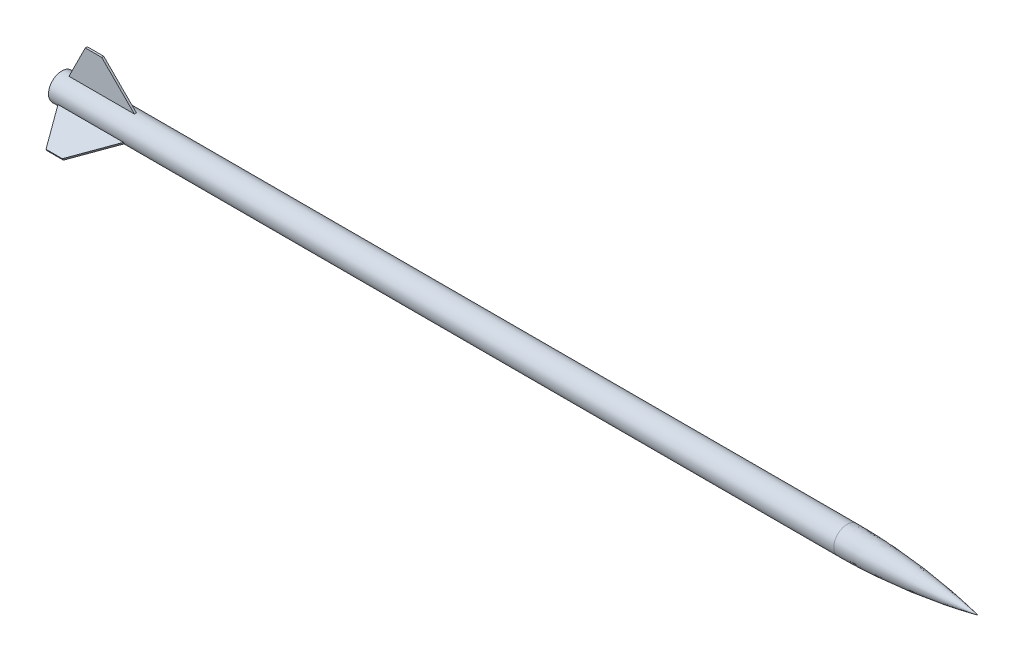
ISO-10303-21;
HEADER;
FILE_DESCRIPTION(('STEP AP214'),'2;1');
FILE_NAME('part.step','',(''),(''),'','','');
FILE_SCHEMA(('AUTOMOTIVE_DESIGN { 1 0 10303 214 1 1 1 1 }'));
ENDSEC;
DATA;
#1=APPLICATION_CONTEXT('core data for automotive mechanical design processes');
#2=APPLICATION_PROTOCOL_DEFINITION('international standard','automotive_design',2000,#1);
#3=PRODUCT_CONTEXT('',#1,'mechanical');
#4=PRODUCT('Part','Part','',(#3));
#5=PRODUCT_RELATED_PRODUCT_CATEGORY('part','',(#4));
#6=PRODUCT_DEFINITION_FORMATION('','',#4);
#7=PRODUCT_DEFINITION_CONTEXT('part definition',#1,'design');
#8=PRODUCT_DEFINITION('design','',#6,#7);
#9=PRODUCT_DEFINITION_SHAPE('','',#8);
#10=(LENGTH_UNIT() NAMED_UNIT(*) SI_UNIT(.MILLI.,.METRE.));
#11=(NAMED_UNIT(*) PLANE_ANGLE_UNIT() SI_UNIT($,.RADIAN.));
#12=(NAMED_UNIT(*) SI_UNIT($,.STERADIAN.) SOLID_ANGLE_UNIT());
#13=UNCERTAINTY_MEASURE_WITH_UNIT(LENGTH_MEASURE(1.E-05),#10,'distance_accuracy_value','');
#14=(GEOMETRIC_REPRESENTATION_CONTEXT(3) GLOBAL_UNCERTAINTY_ASSIGNED_CONTEXT((#13)) GLOBAL_UNIT_ASSIGNED_CONTEXT((#10,
#11,#12)) REPRESENTATION_CONTEXT('',''));
#15=CARTESIAN_POINT('',(0.,0.,0.));
#16=DIRECTION('',(0.,0.,1.));
#17=DIRECTION('',(1.,0.,0.));
#18=AXIS2_PLACEMENT_3D('',#15,#16,#17);
#19=CARTESIAN_POINT('',(406.4,0.,0.));
#20=DIRECTION('',(-1.,0.,0.));
#21=DIRECTION('',(0.,0.,1.));
#22=AXIS2_PLACEMENT_3D('',#19,#20,#21);
#23=CYLINDRICAL_SURFACE('',#22,6.8834);
#24=CARTESIAN_POINT('',(38.1,0.,0.));
#25=DIRECTION('',(-1.,0.,0.));
#26=DIRECTION('',(0.,0.,1.));
#27=AXIS2_PLACEMENT_3D('',#24,#25,#26);
#28=CIRCLE('',#27,6.8834);
#29=CARTESIAN_POINT('',(38.1,-2.97324309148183,-6.20814151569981));
#30=VERTEX_POINT('',#29);
#31=CARTESIAN_POINT('',(38.1,-2.99533813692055,-6.19751119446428));
#32=VERTEX_POINT('',#31);
#33=EDGE_CURVE('E38',#30,#32,#28,.T.);
#34=ORIENTED_EDGE('',*,*,#33,.F.);
#35=DIRECTION('',(-1.,0.,0.));
#36=VECTOR('',#35,1.);
#37=CARTESIAN_POINT('',(406.4,-2.97324309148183,-6.20814151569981));
#38=LINE('',#37,#36);
#39=CARTESIAN_POINT('',(4.23333333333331,-2.97324309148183,-6.20814151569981));
#40=VERTEX_POINT('',#39);
#41=EDGE_CURVE('E11',#30,#40,#38,.T.);
#42=ORIENTED_EDGE('',*,*,#41,.T.);
#43=CARTESIAN_POINT('',(4.23333333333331,0.,0.));
#44=DIRECTION('',(1.,0.,0.));
#45=DIRECTION('',(0.,0.,-1.));
#46=AXIS2_PLACEMENT_3D('',#43,#44,#45);
#47=CIRCLE('',#46,6.8834);
#48=CARTESIAN_POINT('',(4.23333333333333,-2.99533865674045,-6.19751094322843));
#49=VERTEX_POINT('',#48);
#50=EDGE_CURVE('E274',#49,#40,#47,.T.);
#51=ORIENTED_EDGE('',*,*,#50,.F.);
#52=CARTESIAN_POINT('',(0.800897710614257,0.,0.));
#53=DIRECTION('',(0.894427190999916,0.223606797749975,0.387298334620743));
#54=DIRECTION('',(-0.447213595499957,0.447213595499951,0.774596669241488));
#55=AXIS2_PLACEMENT_3D('',#52,#53,#54);
#56=ELLIPSE('',#55,7.69587515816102,6.8834);
#57=CARTESIAN_POINT('',(4.23333333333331,-3.86953258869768,-5.692794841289));
#58=VERTEX_POINT('',#57);
#59=EDGE_CURVE('E273',#58,#49,#56,.T.);
#60=ORIENTED_EDGE('',*,*,#59,.F.);
#61=CARTESIAN_POINT('',(4.23333333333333,-3.88978671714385,-5.67897480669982));
#62=VERTEX_POINT('',#61);
#63=EDGE_CURVE('E270',#62,#58,#47,.T.);
#64=ORIENTED_EDGE('',*,*,#63,.F.);
#65=DIRECTION('',(-1.,0.,0.));
#66=VECTOR('',#65,1.);
#67=CARTESIAN_POINT('',(406.4,-3.88978671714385,-5.67897480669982));
#68=LINE('',#67,#66);
#69=CARTESIAN_POINT('',(38.1,-3.88978671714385,-5.67897480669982));
#70=VERTEX_POINT('',#69);
#71=EDGE_CURVE('E267',#70,#62,#68,.T.);
#72=ORIENTED_EDGE('',*,*,#71,.F.);
#73=CARTESIAN_POINT('',(38.1,-3.8695330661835,-5.69279451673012));
#74=VERTEX_POINT('',#73);
#75=EDGE_CURVE('E277',#74,#70,#28,.T.);
#76=ORIENTED_EDGE('',*,*,#75,.F.);
#77=CARTESIAN_POINT('',(44.9648712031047,0.,0.));
#78=DIRECTION('',(-0.707106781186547,0.353553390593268,0.612372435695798));
#79=DIRECTION('',(-0.707106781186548,-0.353553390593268,-0.612372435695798));
#80=AXIS2_PLACEMENT_3D('',#77,#78,#79);
#81=ELLIPSE('',#80,9.73459763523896,6.8834);
#82=EDGE_CURVE('E48',#32,#74,#81,.T.);
#83=ORIENTED_EDGE('',*,*,#82,.F.);
#84=EDGE_LOOP('',(#34,#42,#51,#60,#64,#72,#76,#83));
#85=FACE_BOUND('',#84,.T.);
#86=CARTESIAN_POINT('',(38.1,0.,0.));
#87=DIRECTION('',(-1.,0.,0.));
#88=DIRECTION('',(0.,0.,1.));
#89=AXIS2_PLACEMENT_3D('',#86,#87,#88);
#90=CIRCLE('',#89,6.8834);
#91=CARTESIAN_POINT('',(38.1,-3.88978671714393,5.67897480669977));
#92=VERTEX_POINT('',#91);
#93=CARTESIAN_POINT('',(38.1,-3.86953306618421,5.69279451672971));
#94=VERTEX_POINT('',#93);
#95=EDGE_CURVE('E211',#92,#94,#90,.T.);
#96=ORIENTED_EDGE('',*,*,#95,.F.);
#97=DIRECTION('',(-1.,0.,0.));
#98=VECTOR('',#97,1.);
#99=CARTESIAN_POINT('',(406.4,-3.88978671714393,5.67897480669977));
#100=LINE('',#99,#98);
#101=CARTESIAN_POINT('',(4.23333333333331,-3.88978671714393,5.67897480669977));
#102=VERTEX_POINT('',#101);
#103=EDGE_CURVE('E265',#92,#102,#100,.T.);
#104=ORIENTED_EDGE('',*,*,#103,.T.);
#105=CARTESIAN_POINT('',(4.23333333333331,0.,0.));
#106=DIRECTION('',(1.,0.,0.));
#107=DIRECTION('',(0.,0.,-1.));
#108=AXIS2_PLACEMENT_3D('',#105,#106,#107);
#109=CIRCLE('',#108,6.8834);
#110=CARTESIAN_POINT('',(4.23333333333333,-3.86953258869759,5.69279484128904));
#111=VERTEX_POINT('',#110);
#112=EDGE_CURVE('E256',#111,#102,#109,.T.);
#113=ORIENTED_EDGE('',*,*,#112,.F.);
#114=CARTESIAN_POINT('',(0.800897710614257,0.,0.));
#115=DIRECTION('',(0.894427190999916,0.22360679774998,-0.38729833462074));
#116=DIRECTION('',(-0.447213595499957,0.447213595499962,-0.774596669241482));
#117=AXIS2_PLACEMENT_3D('',#114,#115,#116);
#118=ELLIPSE('',#117,7.69587515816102,6.8834);
#119=CARTESIAN_POINT('',(4.23333333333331,-2.9953386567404,6.19751094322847));
#120=VERTEX_POINT('',#119);
#121=EDGE_CURVE('E255',#120,#111,#118,.T.);
#122=ORIENTED_EDGE('',*,*,#121,.F.);
#123=CARTESIAN_POINT('',(4.23333333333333,-2.97324309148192,6.20814151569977));
#124=VERTEX_POINT('',#123);
#125=EDGE_CURVE('E252',#124,#120,#109,.T.);
#126=ORIENTED_EDGE('',*,*,#125,.F.);
#127=DIRECTION('',(-1.,0.,0.));
#128=VECTOR('',#127,1.);
#129=CARTESIAN_POINT('',(406.4,-2.97324309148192,6.20814151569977));
#130=LINE('',#129,#128);
#131=CARTESIAN_POINT('',(38.1,-2.97324309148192,6.20814151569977));
#132=VERTEX_POINT('',#131);
#133=EDGE_CURVE('E249',#132,#124,#130,.T.);
#134=ORIENTED_EDGE('',*,*,#133,.F.);
#135=CARTESIAN_POINT('',(38.1,-2.99533813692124,6.19751119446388));
#136=VERTEX_POINT('',#135);
#137=EDGE_CURVE('E259',#136,#132,#90,.T.);
#138=ORIENTED_EDGE('',*,*,#137,.F.);
#139=CARTESIAN_POINT('',(44.9648712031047,0.,0.));
#140=DIRECTION('',(-0.707106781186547,0.353553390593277,-0.612372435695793));
#141=DIRECTION('',(-0.707106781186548,-0.353553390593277,0.612372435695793));
#142=AXIS2_PLACEMENT_3D('',#139,#140,#141);
#143=ELLIPSE('',#142,9.73459763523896,6.8834);
#144=EDGE_CURVE('E262',#94,#136,#143,.T.);
#145=ORIENTED_EDGE('',*,*,#144,.F.);
#146=EDGE_LOOP('',(#96,#104,#113,#122,#126,#134,#138,#145));
#147=FACE_BOUND('',#146,.T.);
#148=CARTESIAN_POINT('',(38.1,0.,0.));
#149=DIRECTION('',(-1.,0.,0.));
#150=DIRECTION('',(0.,0.,1.));
#151=AXIS2_PLACEMENT_3D('',#148,#149,#150);
#152=CIRCLE('',#151,6.8834);
#153=CARTESIAN_POINT('',(38.1,6.86302980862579,0.529166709));
#154=VERTEX_POINT('',#153);
#155=CARTESIAN_POINT('',(38.1,6.86487120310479,0.504716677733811));
#156=VERTEX_POINT('',#155);
#157=EDGE_CURVE('E215',#154,#156,#152,.T.);
#158=ORIENTED_EDGE('',*,*,#157,.F.);
#159=DIRECTION('',(-1.,0.,0.));
#160=VECTOR('',#159,1.);
#161=CARTESIAN_POINT('',(406.4,6.86302980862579,0.529166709));
#162=LINE('',#161,#160);
#163=CARTESIAN_POINT('',(4.23333333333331,6.86302980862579,0.529166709));
#164=VERTEX_POINT('',#163);
#165=EDGE_CURVE('E247',#154,#164,#162,.T.);
#166=ORIENTED_EDGE('',*,*,#165,.T.);
#167=CARTESIAN_POINT('',(4.23333333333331,0.,0.));
#168=DIRECTION('',(1.,0.,0.));
#169=DIRECTION('',(0.,0.,-1.));
#170=AXIS2_PLACEMENT_3D('',#167,#168,#169);
#171=CIRCLE('',#170,6.8834);
#172=CARTESIAN_POINT('',(4.23333333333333,6.86487124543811,0.50471610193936));
#173=VERTEX_POINT('',#172);
#174=EDGE_CURVE('E238',#173,#164,#171,.T.);
#175=ORIENTED_EDGE('',*,*,#174,.F.);
#176=CARTESIAN_POINT('',(0.800897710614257,0.,0.));
#177=DIRECTION('',(0.894427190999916,-0.447213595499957,0.));
#178=DIRECTION('',(-0.447213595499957,-0.894427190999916,0.));
#179=AXIS2_PLACEMENT_3D('',#176,#177,#178);
#180=ELLIPSE('',#179,7.69587515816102,6.8834);
#181=CARTESIAN_POINT('',(4.23333333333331,6.86487124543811,-0.504716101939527));
#182=VERTEX_POINT('',#181);
#183=EDGE_CURVE('E237',#182,#173,#180,.T.);
#184=ORIENTED_EDGE('',*,*,#183,.F.);
#185=CARTESIAN_POINT('',(4.23333333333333,6.86302980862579,-0.529166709));
#186=VERTEX_POINT('',#185);
#187=EDGE_CURVE('E234',#186,#182,#171,.T.);
#188=ORIENTED_EDGE('',*,*,#187,.F.);
#189=DIRECTION('',(-1.,0.,0.));
#190=VECTOR('',#189,1.);
#191=CARTESIAN_POINT('',(406.4,6.86302980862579,-0.529166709));
#192=LINE('',#191,#190);
#193=CARTESIAN_POINT('',(38.1,6.86302980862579,-0.529166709));
#194=VERTEX_POINT('',#193);
#195=EDGE_CURVE('E225',#194,#186,#192,.T.);
#196=ORIENTED_EDGE('',*,*,#195,.F.);
#197=CARTESIAN_POINT('',(38.1,6.86487120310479,-0.504716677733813));
#198=VERTEX_POINT('',#197);
#199=EDGE_CURVE('E241',#198,#194,#152,.T.);
#200=ORIENTED_EDGE('',*,*,#199,.F.);
#201=CARTESIAN_POINT('',(44.9648712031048,0.,0.));
#202=DIRECTION('',(-0.707106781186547,-0.707106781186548,0.));
#203=DIRECTION('',(-0.707106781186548,0.707106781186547,0.));
#204=AXIS2_PLACEMENT_3D('',#201,#202,#203);
#205=ELLIPSE('',#204,9.73459763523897,6.8834);
#206=EDGE_CURVE('E244',#156,#198,#205,.T.);
#207=ORIENTED_EDGE('',*,*,#206,.F.);
#208=EDGE_LOOP('',(#158,#166,#175,#184,#188,#196,#200,#207));
#209=FACE_BOUND('',#208,.T.);
#210=CARTESIAN_POINT('',(406.4,0.,0.));
#211=DIRECTION('',(1.,0.,0.));
#212=DIRECTION('',(0.,0.,-1.));
#213=AXIS2_PLACEMENT_3D('',#210,#211,#212);
#214=CIRCLE('',#213,6.8834);
#215=CARTESIAN_POINT('',(406.4,0.,-6.8834));
#216=VERTEX_POINT('',#215);
#217=EDGE_CURVE('E219',#216,#216,#214,.T.);
#218=ORIENTED_EDGE('',*,*,#217,.F.);
#219=EDGE_LOOP('',(#218));
#220=FACE_BOUND('',#219,.T.);
#221=CARTESIAN_POINT('',(0.,0.,0.));
#222=DIRECTION('',(1.,0.,0.));
#223=DIRECTION('',(0.,0.,-1.));
#224=AXIS2_PLACEMENT_3D('',#221,#222,#223);
#225=CIRCLE('',#224,6.8834);
#226=CARTESIAN_POINT('',(0.,0.,-6.8834));
#227=VERTEX_POINT('',#226);
#228=EDGE_CURVE('E222',#227,#227,#225,.T.);
#229=ORIENTED_EDGE('',*,*,#228,.T.);
#230=EDGE_LOOP('',(#229));
#231=FACE_BOUND('',#230,.T.);
#232=ADVANCED_FACE('F31',(#85,#147,#209,#220,#231),#23,.T.);
#233=CARTESIAN_POINT('',(0.,0.,0.));
#234=DIRECTION('',(1.,0.,0.));
#235=DIRECTION('',(0.,0.,-1.));
#236=AXIS2_PLACEMENT_3D('',#233,#234,#235);
#237=PLANE('',#236);
#238=ORIENTED_EDGE('',*,*,#228,.F.);
#239=EDGE_LOOP('',(#238));
#240=FACE_BOUND('',#239,.T.);
#241=ADVANCED_FACE('F202',(#240),#237,.F.);
#242=CARTESIAN_POINT('',(38.1,5.33791993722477,0.529166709));
#243=DIRECTION('',(-1.,0.,0.));
#244=DIRECTION('',(0.,0.,1.));
#245=AXIS2_PLACEMENT_3D('',#242,#243,#244);
#246=PLANE('',#245);
#247=DIRECTION('',(0.,1.,0.));
#248=VECTOR('',#247,1.);
#249=CARTESIAN_POINT('',(38.1,5.33791993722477,0.529166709));
#250=LINE('',#249,#248);
#251=CARTESIAN_POINT('',(38.1,6.86487120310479,0.529166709));
#252=VERTEX_POINT('',#251);
#253=EDGE_CURVE('E363',#154,#252,#250,.T.);
#254=ORIENTED_EDGE('',*,*,#253,.F.);
#255=ORIENTED_EDGE('',*,*,#157,.T.);
#256=DIRECTION('',(0.,0.,-1.));
#257=VECTOR('',#256,1.);
#258=CARTESIAN_POINT('',(38.1,6.86487120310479,0.529166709));
#259=LINE('',#258,#257);
#260=EDGE_CURVE('E223',#252,#156,#259,.T.);
#261=ORIENTED_EDGE('',*,*,#260,.F.);
#262=EDGE_LOOP('',(#254,#255,#261));
#263=FACE_BOUND('',#262,.T.);
#264=ADVANCED_FACE('F206',(#263),#246,.F.);
#265=CARTESIAN_POINT('',(38.1,6.86487120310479,-0.529166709));
#266=VERTEX_POINT('',#265);
#267=EDGE_CURVE('E228',#198,#266,#259,.T.);
#268=ORIENTED_EDGE('',*,*,#267,.F.);
#269=ORIENTED_EDGE('',*,*,#199,.T.);
#270=DIRECTION('',(0.,1.,0.));
#271=VECTOR('',#270,1.);
#272=CARTESIAN_POINT('',(38.1,5.33791993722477,-0.529166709));
#273=LINE('',#272,#271);
#274=EDGE_CURVE('E348',#194,#266,#273,.T.);
#275=ORIENTED_EDGE('',*,*,#274,.T.);
#276=EDGE_LOOP('',(#268,#269,#275));
#277=FACE_BOUND('',#276,.T.);
#278=ADVANCED_FACE('F390',(#277),#246,.F.);
#279=CARTESIAN_POINT('',(21.1666666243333,23.7982045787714,0.529166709));
#280=DIRECTION('',(-0.707106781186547,-0.707106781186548,0.));
#281=DIRECTION('',(0.707106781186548,-0.707106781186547,0.));
#282=AXIS2_PLACEMENT_3D('',#279,#280,#281);
#283=PLANE('',#282);
#284=ORIENTED_EDGE('',*,*,#260,.T.);
#285=ORIENTED_EDGE('',*,*,#206,.T.);
#286=ORIENTED_EDGE('',*,*,#267,.T.);
#287=DIRECTION('',(-0.707106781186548,0.707106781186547,0.));
#288=VECTOR('',#287,1.);
#289=CARTESIAN_POINT('',(21.1666666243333,23.7982045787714,-0.529166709));
#290=LINE('',#289,#288);
#291=CARTESIAN_POINT('',(21.1666666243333,23.7982045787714,-0.529166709));
#292=VERTEX_POINT('',#291);
#293=EDGE_CURVE('E351',#266,#292,#290,.T.);
#294=ORIENTED_EDGE('',*,*,#293,.T.);
#295=DIRECTION('',(0.,0.,-1.));
#296=VECTOR('',#295,1.);
#297=CARTESIAN_POINT('',(21.1666666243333,23.7982045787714,0.529166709));
#298=LINE('',#297,#296);
#299=CARTESIAN_POINT('',(21.1666666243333,23.7982045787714,0.529166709));
#300=VERTEX_POINT('',#299);
#301=EDGE_CURVE('E379',#300,#292,#298,.T.);
#302=ORIENTED_EDGE('',*,*,#301,.F.);
#303=DIRECTION('',(-0.707106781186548,0.707106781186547,0.));
#304=VECTOR('',#303,1.);
#305=CARTESIAN_POINT('',(21.1666666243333,23.7982045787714,0.529166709));
#306=LINE('',#305,#304);
#307=EDGE_CURVE('E365',#252,#300,#306,.T.);
#308=ORIENTED_EDGE('',*,*,#307,.F.);
#309=EDGE_LOOP('',(#284,#285,#286,#294,#302,#308));
#310=FACE_BOUND('',#309,.T.);
#311=ADVANCED_FACE('F386',(#310),#283,.F.);
#312=CARTESIAN_POINT('',(4.23333333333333,6.86487124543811,0.529166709));
#313=DIRECTION('',(0.894427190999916,-0.447213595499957,0.));
#314=DIRECTION('',(0.447213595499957,0.894427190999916,0.));
#315=AXIS2_PLACEMENT_3D('',#312,#313,#314);
#316=PLANE('',#315);
#317=DIRECTION('',(0.,0.,-1.));
#318=VECTOR('',#317,1.);
#319=CARTESIAN_POINT('',(4.23333333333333,6.86487124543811,0.529166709));
#320=LINE('',#319,#318);
#321=CARTESIAN_POINT('',(4.23333333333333,6.86487124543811,-0.529166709));
#322=VERTEX_POINT('',#321);
#323=EDGE_CURVE('E374',#182,#322,#320,.T.);
#324=ORIENTED_EDGE('',*,*,#323,.F.);
#325=ORIENTED_EDGE('',*,*,#183,.T.);
#326=CARTESIAN_POINT('',(4.23333333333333,6.86487124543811,0.529166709));
#327=VERTEX_POINT('',#326);
#328=EDGE_CURVE('E375',#327,#173,#320,.T.);
#329=ORIENTED_EDGE('',*,*,#328,.F.);
#330=DIRECTION('',(-0.447213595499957,-0.894427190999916,0.));
#331=VECTOR('',#330,1.);
#332=CARTESIAN_POINT('',(4.23333333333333,6.86487124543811,0.529166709));
#333=LINE('',#332,#331);
#334=CARTESIAN_POINT('',(12.7,23.7982045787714,0.529166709));
#335=VERTEX_POINT('',#334);
#336=EDGE_CURVE('E369',#335,#327,#333,.T.);
#337=ORIENTED_EDGE('',*,*,#336,.F.);
#338=DIRECTION('',(0.,0.,-1.));
#339=VECTOR('',#338,1.);
#340=CARTESIAN_POINT('',(12.7,23.7982045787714,0.529166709));
#341=LINE('',#340,#339);
#342=CARTESIAN_POINT('',(12.7,23.7982045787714,-0.529166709));
#343=VERTEX_POINT('',#342);
#344=EDGE_CURVE('E378',#335,#343,#341,.T.);
#345=ORIENTED_EDGE('',*,*,#344,.T.);
#346=DIRECTION('',(-0.447213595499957,-0.894427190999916,0.));
#347=VECTOR('',#346,1.);
#348=CARTESIAN_POINT('',(4.23333333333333,6.86487124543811,-0.529166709));
#349=LINE('',#348,#347);
#350=EDGE_CURVE('E357',#343,#322,#349,.T.);
#351=ORIENTED_EDGE('',*,*,#350,.T.);
#352=EDGE_LOOP('',(#324,#325,#329,#337,#345,#351));
#353=FACE_BOUND('',#352,.T.);
#354=ADVANCED_FACE('F401',(#353),#316,.F.);
#355=CARTESIAN_POINT('',(4.23333333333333,6.86487124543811,0.529166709));
#356=DIRECTION('',(1.,0.,0.));
#357=DIRECTION('',(0.,0.,-1.));
#358=AXIS2_PLACEMENT_3D('',#355,#356,#357);
#359=PLANE('',#358);
#360=DIRECTION('',(0.,-1.,0.));
#361=VECTOR('',#360,1.);
#362=CARTESIAN_POINT('',(4.23333333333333,6.86487124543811,-0.529166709));
#363=LINE('',#362,#361);
#364=EDGE_CURVE('E360',#322,#186,#363,.T.);
#365=ORIENTED_EDGE('',*,*,#364,.T.);
#366=ORIENTED_EDGE('',*,*,#187,.T.);
#367=ORIENTED_EDGE('',*,*,#323,.T.);
#368=EDGE_LOOP('',(#365,#366,#367));
#369=FACE_BOUND('',#368,.T.);
#370=ADVANCED_FACE('F422',(#369),#359,.F.);
#371=ORIENTED_EDGE('',*,*,#328,.T.);
#372=ORIENTED_EDGE('',*,*,#174,.T.);
#373=DIRECTION('',(0.,-1.,0.));
#374=VECTOR('',#373,1.);
#375=CARTESIAN_POINT('',(4.23333333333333,6.86487124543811,0.529166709));
#376=LINE('',#375,#374);
#377=EDGE_CURVE('E371',#327,#164,#376,.T.);
#378=ORIENTED_EDGE('',*,*,#377,.F.);
#379=EDGE_LOOP('',(#371,#372,#378));
#380=FACE_BOUND('',#379,.T.);
#381=ADVANCED_FACE('F425',(#380),#359,.F.);
#382=CARTESIAN_POINT('',(38.1,23.7982045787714,0.529166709));
#383=DIRECTION('',(0.,0.,1.));
#384=DIRECTION('',(1.,0.,0.));
#385=AXIS2_PLACEMENT_3D('',#382,#383,#384);
#386=PLANE('',#385);
#387=ORIENTED_EDGE('',*,*,#165,.F.);
#388=ORIENTED_EDGE('',*,*,#253,.T.);
#389=ORIENTED_EDGE('',*,*,#307,.T.);
#390=DIRECTION('',(-1.,0.,0.));
#391=VECTOR('',#390,1.);
#392=CARTESIAN_POINT('',(21.1666666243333,23.7982045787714,0.529166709));
#393=LINE('',#392,#391);
#394=EDGE_CURVE('E367',#300,#335,#393,.T.);
#395=ORIENTED_EDGE('',*,*,#394,.T.);
#396=ORIENTED_EDGE('',*,*,#336,.T.);
#397=ORIENTED_EDGE('',*,*,#377,.T.);
#398=EDGE_LOOP('',(#387,#388,#389,#395,#396,#397));
#399=FACE_BOUND('',#398,.T.);
#400=ADVANCED_FACE('F404',(#399),#386,.T.);
#401=CARTESIAN_POINT('',(38.1,23.7982045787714,-0.529166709));
#402=DIRECTION('',(0.,0.,1.));
#403=DIRECTION('',(1.,0.,0.));
#404=AXIS2_PLACEMENT_3D('',#401,#402,#403);
#405=PLANE('',#404);
#406=ORIENTED_EDGE('',*,*,#274,.F.);
#407=ORIENTED_EDGE('',*,*,#195,.T.);
#408=ORIENTED_EDGE('',*,*,#364,.F.);
#409=ORIENTED_EDGE('',*,*,#350,.F.);
#410=DIRECTION('',(-1.,0.,0.));
#411=VECTOR('',#410,1.);
#412=CARTESIAN_POINT('',(21.1666666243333,23.7982045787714,-0.529166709));
#413=LINE('',#412,#411);
#414=EDGE_CURVE('E354',#292,#343,#413,.T.);
#415=ORIENTED_EDGE('',*,*,#414,.F.);
#416=ORIENTED_EDGE('',*,*,#293,.F.);
#417=EDGE_LOOP('',(#406,#407,#408,#409,#415,#416));
#418=FACE_BOUND('',#417,.T.);
#419=ADVANCED_FACE('F392',(#418),#405,.F.);
#420=CARTESIAN_POINT('',(21.1666666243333,23.7982045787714,0.529166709));
#421=DIRECTION('',(0.,-1.,0.));
#422=DIRECTION('',(0.,0.,-1.));
#423=AXIS2_PLACEMENT_3D('',#420,#421,#422);
#424=PLANE('',#423);
#425=ORIENTED_EDGE('',*,*,#301,.T.);
#426=ORIENTED_EDGE('',*,*,#414,.T.);
#427=ORIENTED_EDGE('',*,*,#344,.F.);
#428=ORIENTED_EDGE('',*,*,#394,.F.);
#429=EDGE_LOOP('',(#425,#426,#427,#428));
#430=FACE_BOUND('',#429,.T.);
#431=ADVANCED_FACE('F396',(#430),#424,.F.);
#432=CARTESIAN_POINT('',(38.1,-3.12723178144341,4.35819091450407));
#433=DIRECTION('',(-1.,0.,0.));
#434=DIRECTION('',(0.,0.,1.));
#435=AXIS2_PLACEMENT_3D('',#432,#433,#434);
#436=PLANE('',#435);
#437=DIRECTION('',(0.,-0.500000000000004,0.866025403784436));
#438=VECTOR('',#437,1.);
#439=CARTESIAN_POINT('',(38.1,-3.12723178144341,4.35819091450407));
#440=LINE('',#439,#438);
#441=CARTESIAN_POINT('',(38.1,-3.89070741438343,5.68056950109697));
#442=VERTEX_POINT('',#441);
#443=EDGE_CURVE('E325',#92,#442,#440,.T.);
#444=ORIENTED_EDGE('',*,*,#443,.F.);
#445=ORIENTED_EDGE('',*,*,#95,.T.);
#446=DIRECTION('',(0.,0.866025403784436,0.500000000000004));
#447=VECTOR('',#446,1.);
#448=CARTESIAN_POINT('',(38.1,-3.89070741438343,5.68056950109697));
#449=LINE('',#448,#447);
#450=EDGE_CURVE('E345',#442,#94,#449,.T.);
#451=ORIENTED_EDGE('',*,*,#450,.F.);
#452=EDGE_LOOP('',(#444,#445,#451));
#453=FACE_BOUND('',#452,.T.);
#454=ADVANCED_FACE('F419',(#453),#436,.F.);
#455=CARTESIAN_POINT('',(38.1,-2.97416378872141,6.20973621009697));
#456=VERTEX_POINT('',#455);
#457=EDGE_CURVE('E344',#136,#456,#449,.T.);
#458=ORIENTED_EDGE('',*,*,#457,.F.);
#459=ORIENTED_EDGE('',*,*,#137,.T.);
#460=DIRECTION('',(0.,-0.500000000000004,0.866025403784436));
#461=VECTOR('',#460,1.);
#462=CARTESIAN_POINT('',(38.1,-2.2106881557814,4.88735762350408));
#463=LINE('',#462,#461);
#464=EDGE_CURVE('E310',#132,#456,#463,.T.);
#465=ORIENTED_EDGE('',*,*,#464,.T.);
#466=EDGE_LOOP('',(#458,#459,#465));
#467=FACE_BOUND('',#466,.T.);
#468=ADVANCED_FACE('F433',(#467),#436,.F.);
#469=CARTESIAN_POINT('',(21.1666666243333,-12.3573741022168,20.3452663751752));
#470=DIRECTION('',(-0.707106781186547,0.353553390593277,-0.612372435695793));
#471=DIRECTION('',(-0.654653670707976,0.,0.755928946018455));
#472=AXIS2_PLACEMENT_3D('',#469,#470,#471);
#473=PLANE('',#472);
#474=ORIENTED_EDGE('',*,*,#450,.T.);
#475=ORIENTED_EDGE('',*,*,#144,.T.);
#476=ORIENTED_EDGE('',*,*,#457,.T.);
#477=DIRECTION('',(-0.707106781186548,-0.353553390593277,0.612372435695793));
#478=VECTOR('',#477,1.);
#479=CARTESIAN_POINT('',(21.1666666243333,-11.4408304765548,20.8744330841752));
#480=LINE('',#479,#478);
#481=CARTESIAN_POINT('',(21.1666666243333,-11.4408304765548,20.8744330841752));
#482=VERTEX_POINT('',#481);
#483=EDGE_CURVE('E313',#456,#482,#480,.T.);
#484=ORIENTED_EDGE('',*,*,#483,.T.);
#485=DIRECTION('',(0.,0.866025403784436,0.500000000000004));
#486=VECTOR('',#485,1.);
#487=CARTESIAN_POINT('',(21.1666666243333,-12.3573741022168,20.3452663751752));
#488=LINE('',#487,#486);
#489=CARTESIAN_POINT('',(21.1666666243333,-12.3573741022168,20.3452663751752));
#490=VERTEX_POINT('',#489);
#491=EDGE_CURVE('E342',#490,#482,#488,.T.);
#492=ORIENTED_EDGE('',*,*,#491,.F.);
#493=DIRECTION('',(-0.707106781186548,-0.353553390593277,0.612372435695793));
#494=VECTOR('',#493,1.);
#495=CARTESIAN_POINT('',(21.1666666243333,-12.3573741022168,20.3452663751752));
#496=LINE('',#495,#494);
#497=EDGE_CURVE('E327',#442,#490,#496,.T.);
#498=ORIENTED_EDGE('',*,*,#497,.F.);
#499=EDGE_LOOP('',(#474,#475,#476,#484,#492,#498));
#500=FACE_BOUND('',#499,.T.);
#501=ADVANCED_FACE('F435',(#500),#473,.F.);
#502=CARTESIAN_POINT('',(4.23333333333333,-3.89070743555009,5.6805695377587));
#503=DIRECTION('',(0.894427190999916,0.22360679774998,-0.38729833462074));
#504=DIRECTION('',(-0.397359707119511,0.,-0.917662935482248));
#505=AXIS2_PLACEMENT_3D('',#502,#503,#504);
#506=PLANE('',#505);
#507=DIRECTION('',(0.,0.866025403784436,0.500000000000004));
#508=VECTOR('',#507,1.);
#509=CARTESIAN_POINT('',(4.23333333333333,-3.89070743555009,5.6805695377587));
#510=LINE('',#509,#508);
#511=CARTESIAN_POINT('',(4.23333333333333,-2.97416380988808,6.20973624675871));
#512=VERTEX_POINT('',#511);
#513=EDGE_CURVE('E336',#120,#512,#510,.T.);
#514=ORIENTED_EDGE('',*,*,#513,.F.);
#515=ORIENTED_EDGE('',*,*,#121,.T.);
#516=CARTESIAN_POINT('',(4.23333333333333,-3.89070743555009,5.6805695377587));
#517=VERTEX_POINT('',#516);
#518=EDGE_CURVE('E337',#517,#111,#510,.T.);
#519=ORIENTED_EDGE('',*,*,#518,.F.);
#520=DIRECTION('',(-0.447213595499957,0.447213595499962,-0.774596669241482));
#521=VECTOR('',#520,1.);
#522=CARTESIAN_POINT('',(4.23333333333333,-3.89070743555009,5.6805695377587));
#523=LINE('',#522,#521);
#524=CARTESIAN_POINT('',(12.7,-12.3573741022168,20.3452663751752));
#525=VERTEX_POINT('',#524);
#526=EDGE_CURVE('E331',#525,#517,#523,.T.);
#527=ORIENTED_EDGE('',*,*,#526,.F.);
#528=DIRECTION('',(0.,0.866025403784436,0.500000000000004));
#529=VECTOR('',#528,1.);
#530=CARTESIAN_POINT('',(12.7,-12.3573741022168,20.3452663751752));
#531=LINE('',#530,#529);
#532=CARTESIAN_POINT('',(12.7,-11.4408304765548,20.8744330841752));
#533=VERTEX_POINT('',#532);
#534=EDGE_CURVE('E340',#525,#533,#531,.T.);
#535=ORIENTED_EDGE('',*,*,#534,.T.);
#536=DIRECTION('',(-0.447213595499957,0.447213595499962,-0.774596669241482));
#537=VECTOR('',#536,1.);
#538=CARTESIAN_POINT('',(4.23333333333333,-2.97416380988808,6.20973624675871));
#539=LINE('',#538,#537);
#540=EDGE_CURVE('E319',#533,#512,#539,.T.);
#541=ORIENTED_EDGE('',*,*,#540,.T.);
#542=EDGE_LOOP('',(#514,#515,#519,#527,#535,#541));
#543=FACE_BOUND('',#542,.T.);
#544=ADVANCED_FACE('F438',(#543),#506,.F.);
#545=CARTESIAN_POINT('',(4.23333333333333,-3.89070743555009,5.6805695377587));
#546=DIRECTION('',(1.,0.,0.));
#547=DIRECTION('',(0.,0.,-1.));
#548=AXIS2_PLACEMENT_3D('',#545,#546,#547);
#549=PLANE('',#548);
#550=DIRECTION('',(0.,0.500000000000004,-0.866025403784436));
#551=VECTOR('',#550,1.);
#552=CARTESIAN_POINT('',(4.23333333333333,-2.97416380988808,6.20973624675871));
#553=LINE('',#552,#551);
#554=EDGE_CURVE('E322',#512,#124,#553,.T.);
#555=ORIENTED_EDGE('',*,*,#554,.T.);
#556=ORIENTED_EDGE('',*,*,#125,.T.);
#557=ORIENTED_EDGE('',*,*,#513,.T.);
#558=EDGE_LOOP('',(#555,#556,#557));
#559=FACE_BOUND('',#558,.T.);
#560=ADVANCED_FACE('F448',(#559),#549,.F.);
#561=ORIENTED_EDGE('',*,*,#518,.T.);
#562=ORIENTED_EDGE('',*,*,#112,.T.);
#563=DIRECTION('',(0.,0.500000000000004,-0.866025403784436));
#564=VECTOR('',#563,1.);
#565=CARTESIAN_POINT('',(4.23333333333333,-3.89070743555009,5.6805695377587));
#566=LINE('',#565,#564);
#567=EDGE_CURVE('E333',#517,#102,#566,.T.);
#568=ORIENTED_EDGE('',*,*,#567,.F.);
#569=EDGE_LOOP('',(#561,#562,#568));
#570=FACE_BOUND('',#569,.T.);
#571=ADVANCED_FACE('F452',(#570),#549,.F.);
#572=CARTESIAN_POINT('',(38.1,-12.3573741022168,20.3452663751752));
#573=DIRECTION('',(0.,-0.866025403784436,-0.500000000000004));
#574=DIRECTION('',(1.,0.,0.));
#575=AXIS2_PLACEMENT_3D('',#572,#573,#574);
#576=PLANE('',#575);
#577=ORIENTED_EDGE('',*,*,#103,.F.);
#578=ORIENTED_EDGE('',*,*,#443,.T.);
#579=ORIENTED_EDGE('',*,*,#497,.T.);
#580=DIRECTION('',(-1.,0.,0.));
#581=VECTOR('',#580,1.);
#582=CARTESIAN_POINT('',(21.1666666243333,-12.3573741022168,20.3452663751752));
#583=LINE('',#582,#581);
#584=EDGE_CURVE('E329',#490,#525,#583,.T.);
#585=ORIENTED_EDGE('',*,*,#584,.T.);
#586=ORIENTED_EDGE('',*,*,#526,.T.);
#587=ORIENTED_EDGE('',*,*,#567,.T.);
#588=EDGE_LOOP('',(#577,#578,#579,#585,#586,#587));
#589=FACE_BOUND('',#588,.T.);
#590=ADVANCED_FACE('F454',(#589),#576,.T.);
#591=CARTESIAN_POINT('',(38.1,-11.4408304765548,20.8744330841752));
#592=DIRECTION('',(0.,-0.866025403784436,-0.500000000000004));
#593=DIRECTION('',(1.,0.,0.));
#594=AXIS2_PLACEMENT_3D('',#591,#592,#593);
#595=PLANE('',#594);
#596=ORIENTED_EDGE('',*,*,#464,.F.);
#597=ORIENTED_EDGE('',*,*,#133,.T.);
#598=ORIENTED_EDGE('',*,*,#554,.F.);
#599=ORIENTED_EDGE('',*,*,#540,.F.);
#600=DIRECTION('',(-1.,0.,0.));
#601=VECTOR('',#600,1.);
#602=CARTESIAN_POINT('',(21.1666666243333,-11.4408304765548,20.8744330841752));
#603=LINE('',#602,#601);
#604=EDGE_CURVE('E316',#482,#533,#603,.T.);
#605=ORIENTED_EDGE('',*,*,#604,.F.);
#606=ORIENTED_EDGE('',*,*,#483,.F.);
#607=EDGE_LOOP('',(#596,#597,#598,#599,#605,#606));
#608=FACE_BOUND('',#607,.T.);
#609=ADVANCED_FACE('F444',(#608),#595,.F.);
#610=CARTESIAN_POINT('',(21.1666666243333,-12.3573741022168,20.3452663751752));
#611=DIRECTION('',(0.,0.500000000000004,-0.866025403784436));
#612=DIRECTION('',(0.,0.866025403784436,0.500000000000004));
#613=AXIS2_PLACEMENT_3D('',#610,#611,#612);
#614=PLANE('',#613);
#615=ORIENTED_EDGE('',*,*,#491,.T.);
#616=ORIENTED_EDGE('',*,*,#604,.T.);
#617=ORIENTED_EDGE('',*,*,#534,.F.);
#618=ORIENTED_EDGE('',*,*,#584,.F.);
#619=EDGE_LOOP('',(#615,#616,#617,#618));
#620=FACE_BOUND('',#619,.T.);
#621=ADVANCED_FACE('F440',(#620),#614,.F.);
#622=CARTESIAN_POINT('',(38.1,-2.21068815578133,-4.88735762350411));
#623=DIRECTION('',(-1.,0.,0.));
#624=DIRECTION('',(0.,0.,1.));
#625=AXIS2_PLACEMENT_3D('',#622,#623,#624);
#626=PLANE('',#625);
#627=DIRECTION('',(0.,-0.499999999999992,-0.866025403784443));
#628=VECTOR('',#627,1.);
#629=CARTESIAN_POINT('',(38.1,-2.21068815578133,-4.88735762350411));
#630=LINE('',#629,#628);
#631=CARTESIAN_POINT('',(38.1,-2.97416378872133,-6.20973621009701));
#632=VERTEX_POINT('',#631);
#633=EDGE_CURVE('E502',#30,#632,#630,.T.);
#634=ORIENTED_EDGE('',*,*,#633,.F.);
#635=ORIENTED_EDGE('',*,*,#33,.T.);
#636=DIRECTION('',(0.,-0.866025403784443,0.499999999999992));
#637=VECTOR('',#636,1.);
#638=CARTESIAN_POINT('',(38.1,-2.97416378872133,-6.20973621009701));
#639=LINE('',#638,#637);
#640=EDGE_CURVE('E308',#632,#32,#639,.T.);
#641=ORIENTED_EDGE('',*,*,#640,.F.);
#642=EDGE_LOOP('',(#634,#635,#641));
#643=FACE_BOUND('',#642,.T.);
#644=ADVANCED_FACE('F443',(#643),#626,.F.);
#645=CARTESIAN_POINT('',(38.1,-3.89070741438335,-5.68056950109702));
#646=VERTEX_POINT('',#645);
#647=EDGE_CURVE('E307',#74,#646,#639,.T.);
#648=ORIENTED_EDGE('',*,*,#647,.F.);
#649=ORIENTED_EDGE('',*,*,#75,.T.);
#650=DIRECTION('',(0.,-0.499999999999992,-0.866025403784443));
#651=VECTOR('',#650,1.);
#652=CARTESIAN_POINT('',(38.1,-3.12723178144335,-4.35819091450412));
#653=LINE('',#652,#651);
#654=EDGE_CURVE('E484',#70,#646,#653,.T.);
#655=ORIENTED_EDGE('',*,*,#654,.T.);
#656=EDGE_LOOP('',(#648,#649,#655));
#657=FACE_BOUND('',#656,.T.);
#658=ADVANCED_FACE('F463',(#657),#626,.F.);
#659=CARTESIAN_POINT('',(21.1666666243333,-11.4408304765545,-20.8744330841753));
#660=DIRECTION('',(-0.707106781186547,0.353553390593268,0.612372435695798));
#661=DIRECTION('',(0.654653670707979,0.,0.755928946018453));
#662=AXIS2_PLACEMENT_3D('',#659,#660,#661);
#663=PLANE('',#662);
#664=ORIENTED_EDGE('',*,*,#640,.T.);
#665=ORIENTED_EDGE('',*,*,#82,.T.);
#666=ORIENTED_EDGE('',*,*,#647,.T.);
#667=DIRECTION('',(-0.707106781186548,-0.353553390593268,-0.612372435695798));
#668=VECTOR('',#667,1.);
#669=CARTESIAN_POINT('',(21.1666666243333,-12.3573741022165,-20.3452663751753));
#670=LINE('',#669,#668);
#671=CARTESIAN_POINT('',(21.1666666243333,-12.3573741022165,-20.3452663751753));
#672=VERTEX_POINT('',#671);
#673=EDGE_CURVE('E489',#646,#672,#670,.T.);
#674=ORIENTED_EDGE('',*,*,#673,.T.);
#675=DIRECTION('',(0.,-0.866025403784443,0.499999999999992));
#676=VECTOR('',#675,1.);
#677=CARTESIAN_POINT('',(21.1666666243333,-11.4408304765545,-20.8744330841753));
#678=LINE('',#677,#676);
#679=CARTESIAN_POINT('',(21.1666666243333,-11.4408304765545,-20.8744330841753));
#680=VERTEX_POINT('',#679);
#681=EDGE_CURVE('E305',#680,#672,#678,.T.);
#682=ORIENTED_EDGE('',*,*,#681,.F.);
#683=DIRECTION('',(-0.707106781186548,-0.353553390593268,-0.612372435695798));
#684=VECTOR('',#683,1.);
#685=CARTESIAN_POINT('',(21.1666666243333,-11.4408304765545,-20.8744330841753));
#686=LINE('',#685,#684);
#687=EDGE_CURVE('E504',#632,#680,#686,.T.);
#688=ORIENTED_EDGE('',*,*,#687,.F.);
#689=EDGE_LOOP('',(#664,#665,#666,#674,#682,#688));
#690=FACE_BOUND('',#689,.T.);
#691=ADVANCED_FACE('F465',(#690),#663,.F.);
#692=CARTESIAN_POINT('',(4.23333333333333,-2.97416380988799,-6.20973624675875));
#693=DIRECTION('',(0.894427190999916,0.223606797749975,0.387298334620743));
#694=DIRECTION('',(0.397359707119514,0.,-0.917662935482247));
#695=AXIS2_PLACEMENT_3D('',#692,#693,#694);
#696=PLANE('',#695);
#697=DIRECTION('',(0.,-0.866025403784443,0.499999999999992));
#698=VECTOR('',#697,1.);
#699=CARTESIAN_POINT('',(4.23333333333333,-2.97416380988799,-6.20973624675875));
#700=LINE('',#699,#698);
#701=CARTESIAN_POINT('',(4.23333333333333,-3.89070743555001,-5.68056953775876));
#702=VERTEX_POINT('',#701);
#703=EDGE_CURVE('E296',#58,#702,#700,.T.);
#704=ORIENTED_EDGE('',*,*,#703,.F.);
#705=ORIENTED_EDGE('',*,*,#59,.T.);
#706=CARTESIAN_POINT('',(4.23333333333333,-2.97416380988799,-6.20973624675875));
#707=VERTEX_POINT('',#706);
#708=EDGE_CURVE('E290',#707,#49,#700,.T.);
#709=ORIENTED_EDGE('',*,*,#708,.F.);
#710=DIRECTION('',(-0.447213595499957,0.447213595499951,0.774596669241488));
#711=VECTOR('',#710,1.);
#712=CARTESIAN_POINT('',(4.23333333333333,-2.97416380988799,-6.20973624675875));
#713=LINE('',#712,#711);
#714=CARTESIAN_POINT('',(12.7,-11.4408304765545,-20.8744330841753));
#715=VERTEX_POINT('',#714);
#716=EDGE_CURVE('E295',#715,#707,#713,.T.);
#717=ORIENTED_EDGE('',*,*,#716,.F.);
#718=DIRECTION('',(0.,-0.866025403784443,0.499999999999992));
#719=VECTOR('',#718,1.);
#720=CARTESIAN_POINT('',(12.7,-11.4408304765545,-20.8744330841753));
#721=LINE('',#720,#719);
#722=CARTESIAN_POINT('',(12.7,-12.3573741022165,-20.3452663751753));
#723=VERTEX_POINT('',#722);
#724=EDGE_CURVE('E303',#715,#723,#721,.T.);
#725=ORIENTED_EDGE('',*,*,#724,.T.);
#726=DIRECTION('',(-0.447213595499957,0.447213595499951,0.774596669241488));
#727=VECTOR('',#726,1.);
#728=CARTESIAN_POINT('',(4.23333333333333,-3.89070743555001,-5.68056953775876));
#729=LINE('',#728,#727);
#730=EDGE_CURVE('E497',#723,#702,#729,.T.);
#731=ORIENTED_EDGE('',*,*,#730,.T.);
#732=EDGE_LOOP('',(#704,#705,#709,#717,#725,#731));
#733=FACE_BOUND('',#732,.T.);
#734=ADVANCED_FACE('F467',(#733),#696,.F.);
#735=CARTESIAN_POINT('',(4.23333333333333,-2.97416380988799,-6.20973624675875));
#736=DIRECTION('',(1.,0.,0.));
#737=DIRECTION('',(0.,0.,-1.));
#738=AXIS2_PLACEMENT_3D('',#735,#736,#737);
#739=PLANE('',#738);
#740=DIRECTION('',(0.,0.499999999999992,0.866025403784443));
#741=VECTOR('',#740,1.);
#742=CARTESIAN_POINT('',(4.23333333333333,-3.89070743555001,-5.68056953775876));
#743=LINE('',#742,#741);
#744=EDGE_CURVE('E500',#702,#62,#743,.T.);
#745=ORIENTED_EDGE('',*,*,#744,.T.);
#746=ORIENTED_EDGE('',*,*,#63,.T.);
#747=ORIENTED_EDGE('',*,*,#703,.T.);
#748=EDGE_LOOP('',(#745,#746,#747));
#749=FACE_BOUND('',#748,.T.);
#750=ADVANCED_FACE('F471',(#749),#739,.F.);
#751=ORIENTED_EDGE('',*,*,#708,.T.);
#752=ORIENTED_EDGE('',*,*,#50,.T.);
#753=DIRECTION('',(0.,0.499999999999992,0.866025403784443));
#754=VECTOR('',#753,1.);
#755=CARTESIAN_POINT('',(4.23333333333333,-2.97416380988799,-6.20973624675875));
#756=LINE('',#755,#754);
#757=EDGE_CURVE('E288',#707,#40,#756,.T.);
#758=ORIENTED_EDGE('',*,*,#757,.F.);
#759=EDGE_LOOP('',(#751,#752,#758));
#760=FACE_BOUND('',#759,.T.);
#761=ADVANCED_FACE('F287',(#760),#739,.F.);
#762=CARTESIAN_POINT('',(38.1,-11.4408304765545,-20.8744330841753));
#763=DIRECTION('',(0.,0.866025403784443,-0.499999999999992));
#764=DIRECTION('',(1.,0.,0.));
#765=AXIS2_PLACEMENT_3D('',#762,#763,#764);
#766=PLANE('',#765);
#767=ORIENTED_EDGE('',*,*,#41,.F.);
#768=ORIENTED_EDGE('',*,*,#633,.T.);
#769=ORIENTED_EDGE('',*,*,#687,.T.);
#770=DIRECTION('',(-1.,0.,0.));
#771=VECTOR('',#770,1.);
#772=CARTESIAN_POINT('',(21.1666666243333,-11.4408304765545,-20.8744330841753));
#773=LINE('',#772,#771);
#774=EDGE_CURVE('E299',#680,#715,#773,.T.);
#775=ORIENTED_EDGE('',*,*,#774,.T.);
#776=ORIENTED_EDGE('',*,*,#716,.T.);
#777=ORIENTED_EDGE('',*,*,#757,.T.);
#778=EDGE_LOOP('',(#767,#768,#769,#775,#776,#777));
#779=FACE_BOUND('',#778,.T.);
#780=ADVANCED_FACE('F292',(#779),#766,.T.);
#781=CARTESIAN_POINT('',(38.1,-12.3573741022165,-20.3452663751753));
#782=DIRECTION('',(0.,0.866025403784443,-0.499999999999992));
#783=DIRECTION('',(1.,0.,0.));
#784=AXIS2_PLACEMENT_3D('',#781,#782,#783);
#785=PLANE('',#784);
#786=ORIENTED_EDGE('',*,*,#654,.F.);
#787=ORIENTED_EDGE('',*,*,#71,.T.);
#788=ORIENTED_EDGE('',*,*,#744,.F.);
#789=ORIENTED_EDGE('',*,*,#730,.F.);
#790=DIRECTION('',(-1.,0.,0.));
#791=VECTOR('',#790,1.);
#792=CARTESIAN_POINT('',(21.1666666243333,-12.3573741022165,-20.3452663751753));
#793=LINE('',#792,#791);
#794=EDGE_CURVE('E492',#672,#723,#793,.T.);
#795=ORIENTED_EDGE('',*,*,#794,.F.);
#796=ORIENTED_EDGE('',*,*,#673,.F.);
#797=EDGE_LOOP('',(#786,#787,#788,#789,#795,#796));
#798=FACE_BOUND('',#797,.T.);
#799=ADVANCED_FACE('F196',(#798),#785,.F.);
#800=CARTESIAN_POINT('',(21.1666666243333,-11.4408304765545,-20.8744330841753));
#801=DIRECTION('',(0.,0.499999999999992,0.866025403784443));
#802=DIRECTION('',(0.,-0.866025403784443,0.499999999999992));
#803=AXIS2_PLACEMENT_3D('',#800,#801,#802);
#804=PLANE('',#803);
#805=ORIENTED_EDGE('',*,*,#681,.T.);
#806=ORIENTED_EDGE('',*,*,#794,.T.);
#807=ORIENTED_EDGE('',*,*,#724,.F.);
#808=ORIENTED_EDGE('',*,*,#774,.F.);
#809=EDGE_LOOP('',(#805,#806,#807,#808));
#810=FACE_BOUND('',#809,.T.);
#811=ADVANCED_FACE('F190',(#810),#804,.F.);
#812=CARTESIAN_POINT('',(406.4,0.,-329.809632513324));
#813=DIRECTION('',(0.,-1.,0.));
#814=DIRECTION('',(0.,0.,1.));
#815=AXIS2_PLACEMENT_3D('',#812,#813,#814);
#816=CIRCLE('',#815,336.693032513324);
#817=TRIMMED_CURVE('',#816,(PARAMETER_VALUE(-0.202554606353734)),
(PARAMETER_VALUE(0.202554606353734)),.T.,.PARAMETER.);
#818=CARTESIAN_POINT('',(406.4,0.,0.));
#819=DIRECTION('',(-1.,0.,0.));
#820=AXIS1_PLACEMENT('',#818,#819);
#821=SURFACE_OF_REVOLUTION('',#817,#820);
#822=ORIENTED_EDGE('',*,*,#217,.T.);
#823=EDGE_LOOP('',(#822));
#824=FACE_BOUND('',#823,.T.);
#825=CARTESIAN_POINT('',(474.133333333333,0.,0.));
#826=VERTEX_POINT('',#825);
#827=VERTEX_LOOP('',#826);
#828=FACE_BOUND('',#827,.T.);
#829=ADVANCED_FACE('F188',(#824,#828),#821,.T.);
#830=CLOSED_SHELL('',(#232,#241,#264,#278,#311,#354,#370,#381,#400,#419,#431,#454,#468,#501,
#544,#560,#571,#590,#609,#621,#644,#658,#691,#734,#750,#761,#780,#799,#811,#829));
#831=MANIFOLD_SOLID_BREP('B2',#830);
#832=ADVANCED_BREP_SHAPE_REPRESENTATION('',(#18,#831),#14);
#833=SHAPE_DEFINITION_REPRESENTATION(#9,#832);
ENDSEC;
END-ISO-10303-21;
